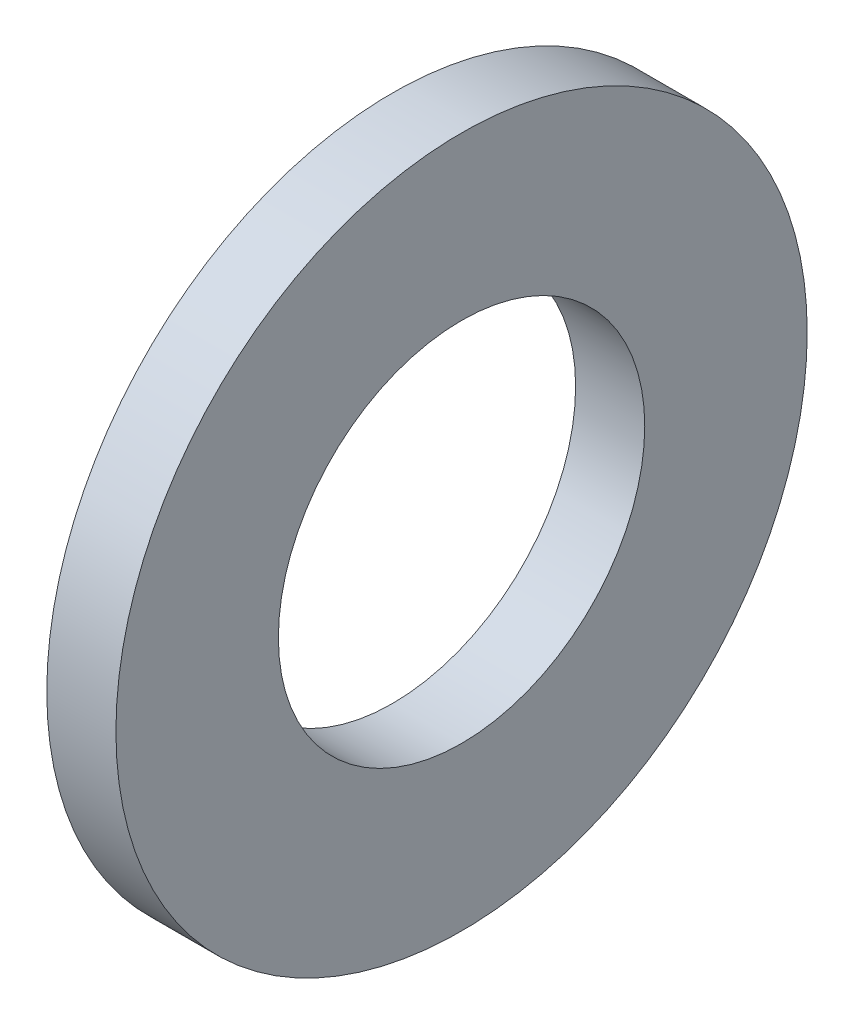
from build123d import *

# Parameters (mm, degrees)
ESQUISSE1_W = 1
ESQUISSE1_H = 2.35


with BuildPart() as part:
    # Esquisse1 → Base-R_volution (revolve)
    with BuildSketch(Plane(origin=(0, 0, 0), x_dir=(1, 0, 0), z_dir=(0, 1, 0)), mode=Mode.PRIVATE) as base_r_volution_sk:
        with Locations((0.5, 3.825)):
            Rectangle(ESQUISSE1_W, ESQUISSE1_H)
    revolve(base_r_volution_sk.sketch.rotate(Axis((0, 0, 0), (1, 0, 0)), 180), axis=Axis((0, 0, 0), (1, 0, 0)))


solid = part.part
